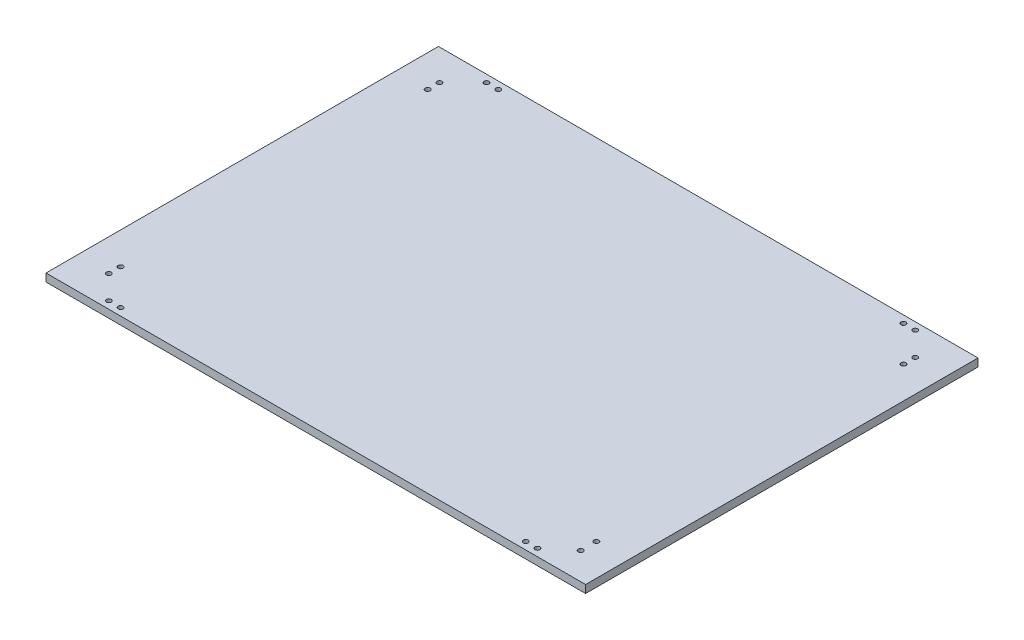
from build123d import *

# Parameters (mm, degrees)
ESQUISSE1_W             = 1100
ESQUISSE1_H             = 800
EXTRUSION1_DEPTH        = 16
ESQUISSE2_R             = 5
ENL_V_MAT_EXTRU_1_DEPTH = 1361.24115509


with BuildPart() as part:
    # Esquisse1 → Extrusion1 (new body)
    with BuildSketch(Plane(origin=(0, 0, 0), x_dir=(1, 0, 0), z_dir=(0, 1, 0))):
        with Locations((550, 400)):
            Rectangle(ESQUISSE1_W, ESQUISSE1_H)
    extrude(amount=EXTRUSION1_DEPTH)

    # Esquisse2 → Enl_v. mat.-Extru.1 (cut, through all)
    with BuildSketch(Plane(origin=(0, 16, 0), x_dir=(-1, 0, 0), z_dir=(0, 1, 0))):
        with Locations(Location((-113, -785, 0), (0, 0, 90))):
            Circle(ESQUISSE2_R)
        with Locations(Location((-65, -713, 0), (0, 0, 270))):
            Circle(ESQUISSE2_R)
        with Locations(Location((-1035, -87, 0), (0, 0, 270))):
            Circle(ESQUISSE2_R)
        with Locations(Location((-65, -63, 0), (0, 0, 270))):
            Circle(ESQUISSE2_R)
        with Locations(Location((-1035, -55, 0), (0, 0, 90))):
            Circle(ESQUISSE2_R)
        with Locations(Location((-1035, -737, 0), (0, 0, 270))):
            Circle(ESQUISSE2_R)
        with Locations(Location((-1035, -713, 0), (0, 0, 90))):
            Circle(ESQUISSE2_R)
        with Locations(Location((-137, -785, 0), (0, 0, 270))):
            Circle(ESQUISSE2_R)
        with Locations(Location((-65, -737, 0), (0, 0, 90))):
            Circle(ESQUISSE2_R)
        with Locations(Location((-137, -15, 0), (0, 0, 90))):
            Circle(ESQUISSE2_R)
        with Locations(Location((-113, -15, 0), (0, 0, 270))):
            Circle(ESQUISSE2_R)
        with Locations(Location((-987, -15, 0), (0, 0, 90))):
            Circle(ESQUISSE2_R)
        with Locations(Location((-963, -15, 0), (0, 0, 270))):
            Circle(ESQUISSE2_R)
        with Locations(Location((-963, -785, 0), (0, 0, 90))):
            Circle(ESQUISSE2_R)
        with Locations(Location((-65, -87, 0), (0, 0, 90))):
            Circle(ESQUISSE2_R)
        with Locations(Location((-987, -785, 0), (0, 0, 270))):
            Circle(ESQUISSE2_R)
    extrude(amount=-ENL_V_MAT_EXTRU_1_DEPTH, mode=Mode.SUBTRACT)


solid = part.part
